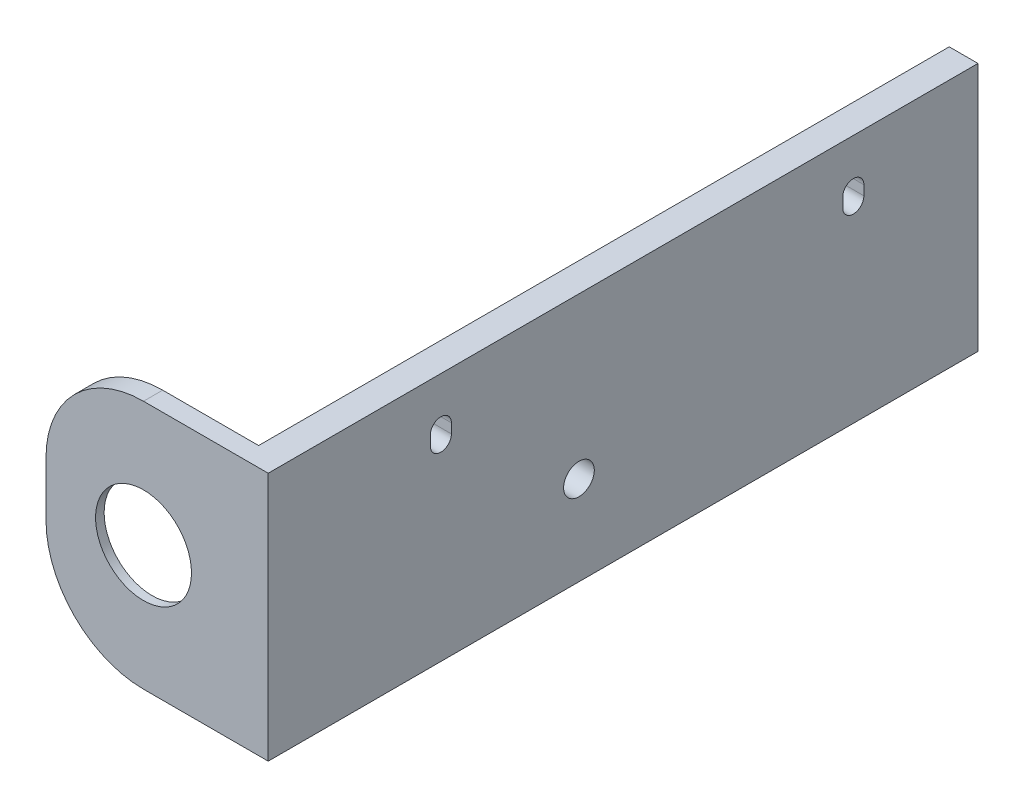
ISO-10303-21;
HEADER;
FILE_DESCRIPTION(('STEP AP214'),'2;1');
FILE_NAME('part.step','',(''),(''),'','','');
FILE_SCHEMA(('AUTOMOTIVE_DESIGN { 1 0 10303 214 1 1 1 1 }'));
ENDSEC;
DATA;
#1=APPLICATION_CONTEXT('core data for automotive mechanical design processes');
#2=APPLICATION_PROTOCOL_DEFINITION('international standard','automotive_design',2000,#1);
#3=PRODUCT_CONTEXT('',#1,'mechanical');
#4=PRODUCT('Part','Part','',(#3));
#5=PRODUCT_RELATED_PRODUCT_CATEGORY('part','',(#4));
#6=PRODUCT_DEFINITION_FORMATION('','',#4);
#7=PRODUCT_DEFINITION_CONTEXT('part definition',#1,'design');
#8=PRODUCT_DEFINITION('design','',#6,#7);
#9=PRODUCT_DEFINITION_SHAPE('','',#8);
#10=(LENGTH_UNIT() NAMED_UNIT(*) SI_UNIT(.MILLI.,.METRE.));
#11=(NAMED_UNIT(*) PLANE_ANGLE_UNIT() SI_UNIT($,.RADIAN.));
#12=(NAMED_UNIT(*) SI_UNIT($,.STERADIAN.) SOLID_ANGLE_UNIT());
#13=UNCERTAINTY_MEASURE_WITH_UNIT(LENGTH_MEASURE(1.E-05),#10,'distance_accuracy_value','');
#14=(GEOMETRIC_REPRESENTATION_CONTEXT(3) GLOBAL_UNCERTAINTY_ASSIGNED_CONTEXT((#13)) GLOBAL_UNIT_ASSIGNED_CONTEXT((#10,
#11,#12)) REPRESENTATION_CONTEXT('',''));
#15=CARTESIAN_POINT('',(0.,0.,0.));
#16=DIRECTION('',(0.,0.,1.));
#17=DIRECTION('',(1.,0.,0.));
#18=AXIS2_PLACEMENT_3D('',#15,#16,#17);
#19=CARTESIAN_POINT('',(0.,0.,0.));
#20=DIRECTION('',(-1.,0.,0.));
#21=DIRECTION('',(0.,0.,1.));
#22=AXIS2_PLACEMENT_3D('',#19,#20,#21);
#23=PLANE('',#22);
#24=DIRECTION('',(0.,1.,0.));
#25=VECTOR('',#24,1.);
#26=CARTESIAN_POINT('',(0.,-1.14106255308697E-13,36.9999999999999));
#27=LINE('',#26,#25);
#28=CARTESIAN_POINT('',(0.,-3.,37.));
#29=VERTEX_POINT('',#28);
#30=CARTESIAN_POINT('',(0.,23.,37.));
#31=VERTEX_POINT('',#30);
#32=EDGE_CURVE('E175',#29,#31,#27,.T.);
#33=ORIENTED_EDGE('',*,*,#32,.T.);
#34=DIRECTION('',(0.,0.,-1.));
#35=VECTOR('',#34,1.);
#36=CARTESIAN_POINT('',(0.,23.,-55.0227155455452));
#37=LINE('',#36,#35);
#38=CARTESIAN_POINT('',(0.,23.,-35.));
#39=VERTEX_POINT('',#38);
#40=EDGE_CURVE('E244',#31,#39,#37,.T.);
#41=ORIENTED_EDGE('',*,*,#40,.T.);
#42=DIRECTION('',(0.,1.,0.));
#43=VECTOR('',#42,1.);
#44=CARTESIAN_POINT('',(0.,-3.,-35.));
#45=LINE('',#44,#43);
#46=CARTESIAN_POINT('',(0.,-3.,-35.));
#47=VERTEX_POINT('',#46);
#48=EDGE_CURVE('E187',#47,#39,#45,.T.);
#49=ORIENTED_EDGE('',*,*,#48,.F.);
#50=DIRECTION('',(0.,0.,-1.));
#51=VECTOR('',#50,1.);
#52=CARTESIAN_POINT('',(0.,-3.,37.));
#53=LINE('',#52,#51);
#54=EDGE_CURVE('E176',#29,#47,#53,.T.);
#55=ORIENTED_EDGE('',*,*,#54,.F.);
#56=EDGE_LOOP('',(#33,#41,#49,#55));
#57=FACE_BOUND('',#56,.T.);
#58=CARTESIAN_POINT('',(0.,6.28093090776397,6.60183408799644));
#59=DIRECTION('',(-1.,0.,0.));
#60=DIRECTION('',(0.,0.,1.));
#61=AXIS2_PLACEMENT_3D('',#58,#59,#60);
#62=CIRCLE('',#61,1.6);
#63=CARTESIAN_POINT('',(0.,6.28093090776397,8.20183408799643));
#64=VERTEX_POINT('',#63);
#65=EDGE_CURVE('E260',#64,#64,#62,.T.);
#66=ORIENTED_EDGE('',*,*,#65,.F.);
#67=EDGE_LOOP('',(#66));
#68=FACE_BOUND('',#67,.T.);
#69=DIRECTION('',(0.,1.,0.));
#70=VECTOR('',#69,1.);
#71=CARTESIAN_POINT('',(0.,0.,22.0999999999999));
#72=LINE('',#71,#70);
#73=CARTESIAN_POINT('',(0.,17.,22.1));
#74=VERTEX_POINT('',#73);
#75=CARTESIAN_POINT('',(0.,18.,22.1));
#76=VERTEX_POINT('',#75);
#77=EDGE_CURVE('E347',#74,#76,#72,.T.);
#78=ORIENTED_EDGE('',*,*,#77,.F.);
#79=CARTESIAN_POINT('',(0.,17.,21.));
#80=DIRECTION('',(-1.,0.,0.));
#81=DIRECTION('',(0.,0.,1.));
#82=AXIS2_PLACEMENT_3D('',#79,#80,#81);
#83=CIRCLE('',#82,1.1);
#84=CARTESIAN_POINT('',(0.,17.,19.9));
#85=VERTEX_POINT('',#84);
#86=EDGE_CURVE('E337',#85,#74,#83,.T.);
#87=ORIENTED_EDGE('',*,*,#86,.F.);
#88=DIRECTION('',(0.,1.,0.));
#89=VECTOR('',#88,1.);
#90=CARTESIAN_POINT('',(0.,0.,19.9000000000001));
#91=LINE('',#90,#89);
#92=CARTESIAN_POINT('',(0.,18.,19.9));
#93=VERTEX_POINT('',#92);
#94=EDGE_CURVE('E340',#85,#93,#91,.T.);
#95=ORIENTED_EDGE('',*,*,#94,.T.);
#96=CARTESIAN_POINT('',(0.,18.,21.));
#97=DIRECTION('',(-1.,0.,0.));
#98=DIRECTION('',(0.,0.,1.));
#99=AXIS2_PLACEMENT_3D('',#96,#97,#98);
#100=CIRCLE('',#99,1.1);
#101=EDGE_CURVE('E344',#76,#93,#100,.T.);
#102=ORIENTED_EDGE('',*,*,#101,.F.);
#103=EDGE_LOOP('',(#78,#87,#95,#102));
#104=FACE_BOUND('',#103,.T.);
#105=DIRECTION('',(0.,1.,0.));
#106=VECTOR('',#105,1.);
#107=CARTESIAN_POINT('',(0.,0.,-20.9000000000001));
#108=LINE('',#107,#106);
#109=CARTESIAN_POINT('',(0.,17.,-20.9));
#110=VERTEX_POINT('',#109);
#111=CARTESIAN_POINT('',(0.,18.,-20.9));
#112=VERTEX_POINT('',#111);
#113=EDGE_CURVE('E330',#110,#112,#108,.T.);
#114=ORIENTED_EDGE('',*,*,#113,.F.);
#115=CARTESIAN_POINT('',(0.,17.,-22.));
#116=DIRECTION('',(-1.,0.,0.));
#117=DIRECTION('',(0.,0.,1.));
#118=AXIS2_PLACEMENT_3D('',#115,#116,#117);
#119=CIRCLE('',#118,1.1);
#120=CARTESIAN_POINT('',(0.,17.,-23.1));
#121=VERTEX_POINT('',#120);
#122=EDGE_CURVE('E333',#110,#121,#119,.F.);
#123=ORIENTED_EDGE('',*,*,#122,.T.);
#124=DIRECTION('',(0.,1.,0.));
#125=VECTOR('',#124,1.);
#126=CARTESIAN_POINT('',(0.,0.,-23.0999999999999));
#127=LINE('',#126,#125);
#128=CARTESIAN_POINT('',(0.,18.,-23.1));
#129=VERTEX_POINT('',#128);
#130=EDGE_CURVE('E288',#121,#129,#127,.T.);
#131=ORIENTED_EDGE('',*,*,#130,.T.);
#132=CARTESIAN_POINT('',(0.,18.,-22.));
#133=DIRECTION('',(-1.,0.,0.));
#134=DIRECTION('',(0.,0.,1.));
#135=AXIS2_PLACEMENT_3D('',#132,#133,#134);
#136=CIRCLE('',#135,1.1);
#137=EDGE_CURVE('E326',#129,#112,#136,.F.);
#138=ORIENTED_EDGE('',*,*,#137,.T.);
#139=EDGE_LOOP('',(#114,#123,#131,#138));
#140=FACE_BOUND('',#139,.T.);
#141=ADVANCED_FACE('F50',(#57,#68,#104,#140),#23,.T.);
#142=CARTESIAN_POINT('',(3.,0.,0.));
#143=DIRECTION('',(-1.,0.,0.));
#144=DIRECTION('',(0.,0.,1.));
#145=AXIS2_PLACEMENT_3D('',#142,#143,#144);
#146=PLANE('',#145);
#147=CARTESIAN_POINT('',(3.,6.28093090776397,6.60183408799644));
#148=DIRECTION('',(-1.,0.,0.));
#149=DIRECTION('',(0.,0.,1.));
#150=AXIS2_PLACEMENT_3D('',#147,#148,#149);
#151=CIRCLE('',#150,1.6);
#152=CARTESIAN_POINT('',(3.,6.28093090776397,8.20183408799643));
#153=VERTEX_POINT('',#152);
#154=EDGE_CURVE('E264',#153,#153,#151,.F.);
#155=ORIENTED_EDGE('',*,*,#154,.F.);
#156=EDGE_LOOP('',(#155));
#157=FACE_BOUND('',#156,.T.);
#158=CARTESIAN_POINT('',(3.,17.,21.));
#159=DIRECTION('',(1.,0.,0.));
#160=DIRECTION('',(0.,0.,-1.));
#161=AXIS2_PLACEMENT_3D('',#158,#159,#160);
#162=CIRCLE('',#161,1.1);
#163=CARTESIAN_POINT('',(3.,17.,22.1));
#164=VERTEX_POINT('',#163);
#165=CARTESIAN_POINT('',(3.,17.,19.9));
#166=VERTEX_POINT('',#165);
#167=EDGE_CURVE('E272',#164,#166,#162,.T.);
#168=ORIENTED_EDGE('',*,*,#167,.F.);
#169=DIRECTION('',(0.,-1.,0.));
#170=VECTOR('',#169,1.);
#171=CARTESIAN_POINT('',(3.,0.,22.0999999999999));
#172=LINE('',#171,#170);
#173=CARTESIAN_POINT('',(3.,18.,22.1));
#174=VERTEX_POINT('',#173);
#175=EDGE_CURVE('E269',#174,#164,#172,.T.);
#176=ORIENTED_EDGE('',*,*,#175,.F.);
#177=CARTESIAN_POINT('',(3.,18.,21.));
#178=DIRECTION('',(1.,0.,0.));
#179=DIRECTION('',(0.,0.,-1.));
#180=AXIS2_PLACEMENT_3D('',#177,#178,#179);
#181=CIRCLE('',#180,1.1);
#182=CARTESIAN_POINT('',(3.,18.,19.9));
#183=VERTEX_POINT('',#182);
#184=EDGE_CURVE('E280',#183,#174,#181,.T.);
#185=ORIENTED_EDGE('',*,*,#184,.F.);
#186=DIRECTION('',(0.,-1.,0.));
#187=VECTOR('',#186,1.);
#188=CARTESIAN_POINT('',(3.,0.,19.9000000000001));
#189=LINE('',#188,#187);
#190=EDGE_CURVE('E276',#183,#166,#189,.T.);
#191=ORIENTED_EDGE('',*,*,#190,.T.);
#192=EDGE_LOOP('',(#168,#176,#185,#191));
#193=FACE_BOUND('',#192,.T.);
#194=DIRECTION('',(0.,0.,1.));
#195=VECTOR('',#194,1.);
#196=CARTESIAN_POINT('',(3.,-3.,-40.));
#197=LINE('',#196,#195);
#198=CARTESIAN_POINT('',(3.,-3.,-35.));
#199=VERTEX_POINT('',#198);
#200=CARTESIAN_POINT('',(3.,-3.,39.));
#201=VERTEX_POINT('',#200);
#202=EDGE_CURVE('E166',#199,#201,#197,.T.);
#203=ORIENTED_EDGE('',*,*,#202,.F.);
#204=DIRECTION('',(0.,-1.,0.));
#205=VECTOR('',#204,1.);
#206=CARTESIAN_POINT('',(3.,23.,-35.));
#207=LINE('',#206,#205);
#208=CARTESIAN_POINT('',(3.,23.,-35.));
#209=VERTEX_POINT('',#208);
#210=EDGE_CURVE('E171',#209,#199,#207,.T.);
#211=ORIENTED_EDGE('',*,*,#210,.F.);
#212=DIRECTION('',(0.,0.,1.));
#213=VECTOR('',#212,1.);
#214=CARTESIAN_POINT('',(3.,23.,-55.0227155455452));
#215=LINE('',#214,#213);
#216=CARTESIAN_POINT('',(3.,23.,39.));
#217=VERTEX_POINT('',#216);
#218=EDGE_CURVE('E222',#209,#217,#215,.T.);
#219=ORIENTED_EDGE('',*,*,#218,.T.);
#220=DIRECTION('',(0.,1.,0.));
#221=VECTOR('',#220,1.);
#222=CARTESIAN_POINT('',(3.,-1.,39.));
#223=LINE('',#222,#221);
#224=EDGE_CURVE('E12',#201,#217,#223,.T.);
#225=ORIENTED_EDGE('',*,*,#224,.F.);
#226=EDGE_LOOP('',(#203,#211,#219,#225));
#227=FACE_BOUND('',#226,.T.);
#228=CARTESIAN_POINT('',(3.,17.,-22.));
#229=DIRECTION('',(1.,0.,0.));
#230=DIRECTION('',(0.,0.,-1.));
#231=AXIS2_PLACEMENT_3D('',#228,#229,#230);
#232=CIRCLE('',#231,1.1);
#233=CARTESIAN_POINT('',(3.,17.,-23.1));
#234=VERTEX_POINT('',#233);
#235=CARTESIAN_POINT('',(3.,17.,-20.9));
#236=VERTEX_POINT('',#235);
#237=EDGE_CURVE('E273',#234,#236,#232,.F.);
#238=ORIENTED_EDGE('',*,*,#237,.T.);
#239=DIRECTION('',(0.,-1.,0.));
#240=VECTOR('',#239,1.);
#241=CARTESIAN_POINT('',(3.,0.,-20.9000000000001));
#242=LINE('',#241,#240);
#243=CARTESIAN_POINT('',(3.,18.,-20.9));
#244=VERTEX_POINT('',#243);
#245=EDGE_CURVE('E301',#244,#236,#242,.T.);
#246=ORIENTED_EDGE('',*,*,#245,.F.);
#247=CARTESIAN_POINT('',(3.,18.,-22.));
#248=DIRECTION('',(1.,0.,0.));
#249=DIRECTION('',(0.,0.,-1.));
#250=AXIS2_PLACEMENT_3D('',#247,#248,#249);
#251=CIRCLE('',#250,1.1);
#252=CARTESIAN_POINT('',(3.,18.,-23.1));
#253=VERTEX_POINT('',#252);
#254=EDGE_CURVE('E312',#244,#253,#251,.F.);
#255=ORIENTED_EDGE('',*,*,#254,.T.);
#256=DIRECTION('',(0.,-1.,0.));
#257=VECTOR('',#256,1.);
#258=CARTESIAN_POINT('',(3.,0.,-23.0999999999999));
#259=LINE('',#258,#257);
#260=EDGE_CURVE('E316',#253,#234,#259,.T.);
#261=ORIENTED_EDGE('',*,*,#260,.T.);
#262=EDGE_LOOP('',(#238,#246,#255,#261));
#263=FACE_BOUND('',#262,.T.);
#264=ADVANCED_FACE('F168',(#157,#193,#227,#263),#146,.F.);
#265=CARTESIAN_POINT('',(-10.,10.,38.2228682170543));
#266=DIRECTION('',(0.,0.,-1.));
#267=DIRECTION('',(-1.,0.,0.));
#268=AXIS2_PLACEMENT_3D('',#265,#266,#267);
#269=CONICAL_SURFACE('',#268,4.7,1.20102779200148);
#270=CARTESIAN_POINT('',(-10.,10.,38.1065891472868));
#271=DIRECTION('',(0.,0.,-1.));
#272=DIRECTION('',(-1.,0.,0.));
#273=AXIS2_PLACEMENT_3D('',#270,#271,#272);
#274=CIRCLE('',#273,5.);
#275=CARTESIAN_POINT('',(-15.,10.,38.1065891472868));
#276=VERTEX_POINT('',#275);
#277=EDGE_CURVE('E350',#276,#276,#274,.F.);
#278=ORIENTED_EDGE('',*,*,#277,.T.);
#279=EDGE_LOOP('',(#278));
#280=FACE_BOUND('',#279,.T.);
#281=CARTESIAN_POINT('',(-10.,10.,37.));
#282=DIRECTION('',(0.,0.,-1.));
#283=DIRECTION('',(0.,1.,0.));
#284=AXIS2_PLACEMENT_3D('',#281,#282,#283);
#285=CIRCLE('',#284,7.85499999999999);
#286=CARTESIAN_POINT('',(-10.,17.855,37.));
#287=VERTEX_POINT('',#286);
#288=EDGE_CURVE('E60',#287,#287,#285,.F.);
#289=ORIENTED_EDGE('',*,*,#288,.F.);
#290=EDGE_LOOP('',(#289));
#291=FACE_BOUND('',#290,.T.);
#292=ADVANCED_FACE('F360',(#280,#291),#269,.F.);
#293=CARTESIAN_POINT('',(0.,0.,39.));
#294=DIRECTION('',(0.,0.,1.));
#295=DIRECTION('',(1.,0.,0.));
#296=AXIS2_PLACEMENT_3D('',#293,#294,#295);
#297=PLANE('',#296);
#298=CARTESIAN_POINT('',(-10.,10.,39.));
#299=DIRECTION('',(0.,0.,1.));
#300=DIRECTION('',(1.,0.,0.));
#301=AXIS2_PLACEMENT_3D('',#298,#299,#300);
#302=CIRCLE('',#301,5.);
#303=CARTESIAN_POINT('',(-5.,10.,39.));
#304=VERTEX_POINT('',#303);
#305=EDGE_CURVE('E54',#304,#304,#302,.T.);
#306=ORIENTED_EDGE('',*,*,#305,.F.);
#307=EDGE_LOOP('',(#306));
#308=FACE_BOUND('',#307,.T.);
#309=CARTESIAN_POINT('',(-10.,7.16666666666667,39.));
#310=DIRECTION('',(0.,0.,1.));
#311=DIRECTION('',(1.,0.,0.));
#312=AXIS2_PLACEMENT_3D('',#309,#310,#311);
#313=CIRCLE('',#312,10.1666666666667);
#314=CARTESIAN_POINT('',(-10.,-3.,39.));
#315=VERTEX_POINT('',#314);
#316=CARTESIAN_POINT('',(-20.1666666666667,7.16666666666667,39.));
#317=VERTEX_POINT('',#316);
#318=EDGE_CURVE('E200',#315,#317,#313,.F.);
#319=ORIENTED_EDGE('',*,*,#318,.F.);
#320=DIRECTION('',(-1.,0.,0.));
#321=VECTOR('',#320,1.);
#322=CARTESIAN_POINT('',(3.,-3.,39.));
#323=LINE('',#322,#321);
#324=EDGE_CURVE('E247',#201,#315,#323,.T.);
#325=ORIENTED_EDGE('',*,*,#324,.F.);
#326=ORIENTED_EDGE('',*,*,#224,.T.);
#327=DIRECTION('',(-1.,0.,0.));
#328=VECTOR('',#327,1.);
#329=CARTESIAN_POINT('',(0.,23.,39.));
#330=LINE('',#329,#328);
#331=CARTESIAN_POINT('',(-10.,23.,39.));
#332=VERTEX_POINT('',#331);
#333=EDGE_CURVE('E232',#217,#332,#330,.T.);
#334=ORIENTED_EDGE('',*,*,#333,.T.);
#335=CARTESIAN_POINT('',(-10.,12.8333333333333,39.));
#336=DIRECTION('',(0.,0.,1.));
#337=DIRECTION('',(1.,0.,0.));
#338=AXIS2_PLACEMENT_3D('',#335,#336,#337);
#339=CIRCLE('',#338,10.1666666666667);
#340=CARTESIAN_POINT('',(-20.1666666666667,12.8333333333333,39.));
#341=VERTEX_POINT('',#340);
#342=EDGE_CURVE('E207',#332,#341,#339,.T.);
#343=ORIENTED_EDGE('',*,*,#342,.T.);
#344=DIRECTION('',(0.,1.,0.));
#345=VECTOR('',#344,1.);
#346=CARTESIAN_POINT('',(-20.1666666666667,0.,39.));
#347=LINE('',#346,#345);
#348=EDGE_CURVE('E201',#317,#341,#347,.T.);
#349=ORIENTED_EDGE('',*,*,#348,.F.);
#350=EDGE_LOOP('',(#319,#325,#326,#334,#343,#349));
#351=FACE_BOUND('',#350,.T.);
#352=ADVANCED_FACE('F52',(#308,#351),#297,.T.);
#353=CARTESIAN_POINT('',(-10.,10.,37.));
#354=DIRECTION('',(0.,0.,-1.));
#355=DIRECTION('',(0.,1.,0.));
#356=AXIS2_PLACEMENT_3D('',#353,#354,#355);
#357=PLANE('',#356);
#358=ORIENTED_EDGE('',*,*,#288,.T.);
#359=EDGE_LOOP('',(#358));
#360=FACE_BOUND('',#359,.T.);
#361=DIRECTION('',(1.,0.,0.));
#362=VECTOR('',#361,1.);
#363=CARTESIAN_POINT('',(-10.,-3.,37.));
#364=LINE('',#363,#362);
#365=CARTESIAN_POINT('',(-10.,-3.,37.));
#366=VERTEX_POINT('',#365);
#367=EDGE_CURVE('E253',#366,#29,#364,.T.);
#368=ORIENTED_EDGE('',*,*,#367,.F.);
#369=CARTESIAN_POINT('',(-10.,7.16666666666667,37.));
#370=DIRECTION('',(0.,0.,-1.));
#371=DIRECTION('',(0.,1.,0.));
#372=AXIS2_PLACEMENT_3D('',#369,#370,#371);
#373=CIRCLE('',#372,10.1666666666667);
#374=CARTESIAN_POINT('',(-20.1666666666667,7.16666666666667,37.));
#375=VERTEX_POINT('',#374);
#376=EDGE_CURVE('E211',#366,#375,#373,.T.);
#377=ORIENTED_EDGE('',*,*,#376,.T.);
#378=DIRECTION('',(0.,1.,0.));
#379=VECTOR('',#378,1.);
#380=CARTESIAN_POINT('',(-20.1666666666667,0.,37.));
#381=LINE('',#380,#379);
#382=CARTESIAN_POINT('',(-20.1666666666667,12.8333333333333,37.));
#383=VERTEX_POINT('',#382);
#384=EDGE_CURVE('E218',#375,#383,#381,.T.);
#385=ORIENTED_EDGE('',*,*,#384,.T.);
#386=CARTESIAN_POINT('',(-10.,12.8333333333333,37.));
#387=DIRECTION('',(0.,0.,-1.));
#388=DIRECTION('',(0.,1.,0.));
#389=AXIS2_PLACEMENT_3D('',#386,#387,#388);
#390=CIRCLE('',#389,10.1666666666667);
#391=CARTESIAN_POINT('',(-10.,23.,37.));
#392=VERTEX_POINT('',#391);
#393=EDGE_CURVE('E205',#392,#383,#390,.F.);
#394=ORIENTED_EDGE('',*,*,#393,.F.);
#395=DIRECTION('',(1.,0.,0.));
#396=VECTOR('',#395,1.);
#397=CARTESIAN_POINT('',(0.,23.,37.));
#398=LINE('',#397,#396);
#399=EDGE_CURVE('E240',#392,#31,#398,.T.);
#400=ORIENTED_EDGE('',*,*,#399,.T.);
#401=ORIENTED_EDGE('',*,*,#32,.F.);
#402=EDGE_LOOP('',(#368,#377,#385,#394,#400,#401));
#403=FACE_BOUND('',#402,.T.);
#404=ADVANCED_FACE('F357',(#360,#403),#357,.T.);
#405=CARTESIAN_POINT('',(-10.,10.,60.));
#406=DIRECTION('',(0.,0.,-1.));
#407=DIRECTION('',(0.,1.,0.));
#408=AXIS2_PLACEMENT_3D('',#405,#406,#407);
#409=CYLINDRICAL_SURFACE('',#408,5.);
#410=ORIENTED_EDGE('',*,*,#305,.T.);
#411=EDGE_LOOP('',(#410));
#412=FACE_BOUND('',#411,.T.);
#413=ORIENTED_EDGE('',*,*,#277,.F.);
#414=EDGE_LOOP('',(#413));
#415=FACE_BOUND('',#414,.T.);
#416=ADVANCED_FACE('F381',(#412,#415),#409,.F.);
#417=CARTESIAN_POINT('',(-7.,17.,-22.));
#418=DIRECTION('',(1.,0.,0.));
#419=DIRECTION('',(0.,0.,-1.));
#420=AXIS2_PLACEMENT_3D('',#417,#418,#419);
#421=CYLINDRICAL_SURFACE('',#420,1.1);
#422=DIRECTION('',(1.,0.,0.));
#423=VECTOR('',#422,1.);
#424=CARTESIAN_POINT('',(-7.,17.,-20.9));
#425=LINE('',#424,#423);
#426=EDGE_CURVE('E268',#110,#236,#425,.T.);
#427=ORIENTED_EDGE('',*,*,#426,.T.);
#428=ORIENTED_EDGE('',*,*,#237,.F.);
#429=DIRECTION('',(1.,0.,0.));
#430=VECTOR('',#429,1.);
#431=CARTESIAN_POINT('',(-7.,17.,-23.1));
#432=LINE('',#431,#430);
#433=EDGE_CURVE('E297',#121,#234,#432,.T.);
#434=ORIENTED_EDGE('',*,*,#433,.F.);
#435=ORIENTED_EDGE('',*,*,#122,.F.);
#436=EDGE_LOOP('',(#427,#428,#434,#435));
#437=FACE_BOUND('',#436,.T.);
#438=ADVANCED_FACE('F383',(#437),#421,.F.);
#439=CARTESIAN_POINT('',(-7.,0.,-20.9000000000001));
#440=DIRECTION('',(0.,0.,1.));
#441=DIRECTION('',(0.,-1.,0.));
#442=AXIS2_PLACEMENT_3D('',#439,#440,#441);
#443=PLANE('',#442);
#444=ORIENTED_EDGE('',*,*,#113,.T.);
#445=DIRECTION('',(1.,0.,0.));
#446=VECTOR('',#445,1.);
#447=CARTESIAN_POINT('',(-7.,18.,-20.9));
#448=LINE('',#447,#446);
#449=EDGE_CURVE('E304',#112,#244,#448,.T.);
#450=ORIENTED_EDGE('',*,*,#449,.T.);
#451=ORIENTED_EDGE('',*,*,#245,.T.);
#452=ORIENTED_EDGE('',*,*,#426,.F.);
#453=EDGE_LOOP('',(#444,#450,#451,#452));
#454=FACE_BOUND('',#453,.T.);
#455=ADVANCED_FACE('F385',(#454),#443,.F.);
#456=CARTESIAN_POINT('',(-7.,18.,-22.));
#457=DIRECTION('',(1.,0.,0.));
#458=DIRECTION('',(0.,0.,-1.));
#459=AXIS2_PLACEMENT_3D('',#456,#457,#458);
#460=CYLINDRICAL_SURFACE('',#459,1.1);
#461=DIRECTION('',(1.,0.,0.));
#462=VECTOR('',#461,1.);
#463=CARTESIAN_POINT('',(-7.,18.,-23.1));
#464=LINE('',#463,#462);
#465=EDGE_CURVE('E76',#129,#253,#464,.T.);
#466=ORIENTED_EDGE('',*,*,#465,.T.);
#467=ORIENTED_EDGE('',*,*,#254,.F.);
#468=ORIENTED_EDGE('',*,*,#449,.F.);
#469=ORIENTED_EDGE('',*,*,#137,.F.);
#470=EDGE_LOOP('',(#466,#467,#468,#469));
#471=FACE_BOUND('',#470,.T.);
#472=ADVANCED_FACE('F388',(#471),#460,.F.);
#473=CARTESIAN_POINT('',(-7.,0.,-23.0999999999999));
#474=DIRECTION('',(0.,0.,1.));
#475=DIRECTION('',(0.,-1.,0.));
#476=AXIS2_PLACEMENT_3D('',#473,#474,#475);
#477=PLANE('',#476);
#478=ORIENTED_EDGE('',*,*,#433,.T.);
#479=ORIENTED_EDGE('',*,*,#260,.F.);
#480=ORIENTED_EDGE('',*,*,#465,.F.);
#481=ORIENTED_EDGE('',*,*,#130,.F.);
#482=EDGE_LOOP('',(#478,#479,#480,#481));
#483=FACE_BOUND('',#482,.T.);
#484=ADVANCED_FACE('F392',(#483),#477,.T.);
#485=CARTESIAN_POINT('',(-7.,0.,22.0999999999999));
#486=DIRECTION('',(0.,0.,1.));
#487=DIRECTION('',(0.,-1.,0.));
#488=AXIS2_PLACEMENT_3D('',#485,#486,#487);
#489=PLANE('',#488);
#490=ORIENTED_EDGE('',*,*,#77,.T.);
#491=DIRECTION('',(1.,0.,0.));
#492=VECTOR('',#491,1.);
#493=CARTESIAN_POINT('',(-7.,18.,22.1));
#494=LINE('',#493,#492);
#495=EDGE_CURVE('E285',#76,#174,#494,.T.);
#496=ORIENTED_EDGE('',*,*,#495,.T.);
#497=ORIENTED_EDGE('',*,*,#175,.T.);
#498=DIRECTION('',(1.,0.,0.));
#499=VECTOR('',#498,1.);
#500=CARTESIAN_POINT('',(-7.,17.,22.1));
#501=LINE('',#500,#499);
#502=EDGE_CURVE('E284',#74,#164,#501,.T.);
#503=ORIENTED_EDGE('',*,*,#502,.F.);
#504=EDGE_LOOP('',(#490,#496,#497,#503));
#505=FACE_BOUND('',#504,.T.);
#506=ADVANCED_FACE('F396',(#505),#489,.F.);
#507=CARTESIAN_POINT('',(-7.,18.,21.));
#508=DIRECTION('',(1.,0.,0.));
#509=DIRECTION('',(0.,0.,-1.));
#510=AXIS2_PLACEMENT_3D('',#507,#508,#509);
#511=CYLINDRICAL_SURFACE('',#510,1.1);
#512=ORIENTED_EDGE('',*,*,#101,.T.);
#513=DIRECTION('',(1.,0.,0.));
#514=VECTOR('',#513,1.);
#515=CARTESIAN_POINT('',(-7.,18.,19.9));
#516=LINE('',#515,#514);
#517=EDGE_CURVE('E289',#93,#183,#516,.T.);
#518=ORIENTED_EDGE('',*,*,#517,.T.);
#519=ORIENTED_EDGE('',*,*,#184,.T.);
#520=ORIENTED_EDGE('',*,*,#495,.F.);
#521=EDGE_LOOP('',(#512,#518,#519,#520));
#522=FACE_BOUND('',#521,.T.);
#523=ADVANCED_FACE('F402',(#522),#511,.F.);
#524=CARTESIAN_POINT('',(-7.,0.,19.9000000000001));
#525=DIRECTION('',(0.,0.,1.));
#526=DIRECTION('',(0.,-1.,0.));
#527=AXIS2_PLACEMENT_3D('',#524,#525,#526);
#528=PLANE('',#527);
#529=DIRECTION('',(1.,0.,0.));
#530=VECTOR('',#529,1.);
#531=CARTESIAN_POINT('',(-7.,17.,19.9));
#532=LINE('',#531,#530);
#533=EDGE_CURVE('E68',#85,#166,#532,.T.);
#534=ORIENTED_EDGE('',*,*,#533,.T.);
#535=ORIENTED_EDGE('',*,*,#190,.F.);
#536=ORIENTED_EDGE('',*,*,#517,.F.);
#537=ORIENTED_EDGE('',*,*,#94,.F.);
#538=EDGE_LOOP('',(#534,#535,#536,#537));
#539=FACE_BOUND('',#538,.T.);
#540=ADVANCED_FACE('F408',(#539),#528,.T.);
#541=CARTESIAN_POINT('',(-7.,17.,21.));
#542=DIRECTION('',(1.,0.,0.));
#543=DIRECTION('',(0.,0.,-1.));
#544=AXIS2_PLACEMENT_3D('',#541,#542,#543);
#545=CYLINDRICAL_SURFACE('',#544,1.1);
#546=ORIENTED_EDGE('',*,*,#86,.T.);
#547=ORIENTED_EDGE('',*,*,#502,.T.);
#548=ORIENTED_EDGE('',*,*,#167,.T.);
#549=ORIENTED_EDGE('',*,*,#533,.F.);
#550=EDGE_LOOP('',(#546,#547,#548,#549));
#551=FACE_BOUND('',#550,.T.);
#552=ADVANCED_FACE('F404',(#551),#545,.F.);
#553=CARTESIAN_POINT('',(7.5254833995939,6.28093090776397,6.60183408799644));
#554=DIRECTION('',(-1.,0.,0.));
#555=DIRECTION('',(0.,0.,1.));
#556=AXIS2_PLACEMENT_3D('',#553,#554,#555);
#557=CYLINDRICAL_SURFACE('',#556,1.6);
#558=ORIENTED_EDGE('',*,*,#154,.T.);
#559=EDGE_LOOP('',(#558));
#560=FACE_BOUND('',#559,.T.);
#561=ORIENTED_EDGE('',*,*,#65,.T.);
#562=EDGE_LOOP('',(#561));
#563=FACE_BOUND('',#562,.T.);
#564=ADVANCED_FACE('F407',(#560,#563),#557,.F.);
#565=CARTESIAN_POINT('',(0.,-3.,0.));
#566=DIRECTION('',(0.,-1.,0.));
#567=DIRECTION('',(0.,0.,-1.));
#568=AXIS2_PLACEMENT_3D('',#565,#566,#567);
#569=PLANE('',#568);
#570=ORIENTED_EDGE('',*,*,#54,.T.);
#571=DIRECTION('',(-1.,0.,0.));
#572=VECTOR('',#571,1.);
#573=CARTESIAN_POINT('',(3.,-3.,-35.));
#574=LINE('',#573,#572);
#575=EDGE_CURVE('E179',#199,#47,#574,.T.);
#576=ORIENTED_EDGE('',*,*,#575,.F.);
#577=ORIENTED_EDGE('',*,*,#202,.T.);
#578=ORIENTED_EDGE('',*,*,#324,.T.);
#579=DIRECTION('',(0.,0.,-1.));
#580=VECTOR('',#579,1.);
#581=CARTESIAN_POINT('',(-10.,-3.,39.));
#582=LINE('',#581,#580);
#583=EDGE_CURVE('E250',#315,#366,#582,.T.);
#584=ORIENTED_EDGE('',*,*,#583,.T.);
#585=ORIENTED_EDGE('',*,*,#367,.T.);
#586=EDGE_LOOP('',(#570,#576,#577,#578,#584,#585));
#587=FACE_BOUND('',#586,.T.);
#588=ADVANCED_FACE('F180',(#587),#569,.T.);
#589=CARTESIAN_POINT('',(0.,23.,0.));
#590=DIRECTION('',(0.,-1.,0.));
#591=DIRECTION('',(0.,0.,-1.));
#592=AXIS2_PLACEMENT_3D('',#589,#590,#591);
#593=PLANE('',#592);
#594=ORIENTED_EDGE('',*,*,#218,.F.);
#595=DIRECTION('',(1.,0.,0.));
#596=VECTOR('',#595,1.);
#597=CARTESIAN_POINT('',(0.,23.,-35.));
#598=LINE('',#597,#596);
#599=EDGE_CURVE('E192',#39,#209,#598,.T.);
#600=ORIENTED_EDGE('',*,*,#599,.F.);
#601=ORIENTED_EDGE('',*,*,#40,.F.);
#602=ORIENTED_EDGE('',*,*,#399,.F.);
#603=DIRECTION('',(0.,0.,-1.));
#604=VECTOR('',#603,1.);
#605=CARTESIAN_POINT('',(-10.,23.,-55.0227155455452));
#606=LINE('',#605,#604);
#607=EDGE_CURVE('E236',#332,#392,#606,.T.);
#608=ORIENTED_EDGE('',*,*,#607,.F.);
#609=ORIENTED_EDGE('',*,*,#333,.F.);
#610=EDGE_LOOP('',(#594,#600,#601,#602,#608,#609));
#611=FACE_BOUND('',#610,.T.);
#612=ADVANCED_FACE('F420',(#611),#593,.F.);
#613=CARTESIAN_POINT('',(-10.,7.16666666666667,9.08296020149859));
#614=DIRECTION('',(0.,0.,1.));
#615=DIRECTION('',(1.,0.,0.));
#616=AXIS2_PLACEMENT_3D('',#613,#614,#615);
#617=CYLINDRICAL_SURFACE('',#616,10.1666666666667);
#618=ORIENTED_EDGE('',*,*,#376,.F.);
#619=ORIENTED_EDGE('',*,*,#583,.F.);
#620=ORIENTED_EDGE('',*,*,#318,.T.);
#621=DIRECTION('',(0.,0.,1.));
#622=VECTOR('',#621,1.);
#623=CARTESIAN_POINT('',(-20.1666666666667,7.16666666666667,9.08296020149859));
#624=LINE('',#623,#622);
#625=EDGE_CURVE('E206',#375,#317,#624,.T.);
#626=ORIENTED_EDGE('',*,*,#625,.F.);
#627=EDGE_LOOP('',(#618,#619,#620,#626));
#628=FACE_BOUND('',#627,.T.);
#629=ADVANCED_FACE('F423',(#628),#617,.T.);
#630=CARTESIAN_POINT('',(-20.1666666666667,0.,9.08296020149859));
#631=DIRECTION('',(1.,0.,0.));
#632=DIRECTION('',(0.,0.,-1.));
#633=AXIS2_PLACEMENT_3D('',#630,#631,#632);
#634=PLANE('',#633);
#635=ORIENTED_EDGE('',*,*,#384,.F.);
#636=ORIENTED_EDGE('',*,*,#625,.T.);
#637=ORIENTED_EDGE('',*,*,#348,.T.);
#638=DIRECTION('',(0.,0.,1.));
#639=VECTOR('',#638,1.);
#640=CARTESIAN_POINT('',(-20.1666666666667,12.8333333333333,9.08296020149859));
#641=LINE('',#640,#639);
#642=EDGE_CURVE('E212',#383,#341,#641,.T.);
#643=ORIENTED_EDGE('',*,*,#642,.F.);
#644=EDGE_LOOP('',(#635,#636,#637,#643));
#645=FACE_BOUND('',#644,.T.);
#646=ADVANCED_FACE('F427',(#645),#634,.F.);
#647=CARTESIAN_POINT('',(-10.,12.8333333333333,9.08296020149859));
#648=DIRECTION('',(0.,0.,1.));
#649=DIRECTION('',(1.,0.,0.));
#650=AXIS2_PLACEMENT_3D('',#647,#648,#649);
#651=CYLINDRICAL_SURFACE('',#650,10.1666666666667);
#652=ORIENTED_EDGE('',*,*,#607,.T.);
#653=ORIENTED_EDGE('',*,*,#393,.T.);
#654=ORIENTED_EDGE('',*,*,#642,.T.);
#655=ORIENTED_EDGE('',*,*,#342,.F.);
#656=EDGE_LOOP('',(#652,#653,#654,#655));
#657=FACE_BOUND('',#656,.T.);
#658=ADVANCED_FACE('F431',(#657),#651,.T.);
#659=CARTESIAN_POINT('',(0.,0.,-35.));
#660=DIRECTION('',(0.,0.,-1.));
#661=DIRECTION('',(-1.,0.,0.));
#662=AXIS2_PLACEMENT_3D('',#659,#660,#661);
#663=PLANE('',#662);
#664=ORIENTED_EDGE('',*,*,#210,.T.);
#665=ORIENTED_EDGE('',*,*,#575,.T.);
#666=ORIENTED_EDGE('',*,*,#48,.T.);
#667=ORIENTED_EDGE('',*,*,#599,.T.);
#668=EDGE_LOOP('',(#664,#665,#666,#667));
#669=FACE_BOUND('',#668,.T.);
#670=ADVANCED_FACE('F190',(#669),#663,.T.);
#671=CLOSED_SHELL('',(#141,#264,#292,#352,#404,#416,#438,#455,#472,#484,#506,#523,#540,#552,
#564,#588,#612,#629,#646,#658,#670));
#672=MANIFOLD_SOLID_BREP('B2',#671);
#673=ADVANCED_BREP_SHAPE_REPRESENTATION('',(#18,#672),#14);
#674=SHAPE_DEFINITION_REPRESENTATION(#9,#673);
ENDSEC;
END-ISO-10303-21;
